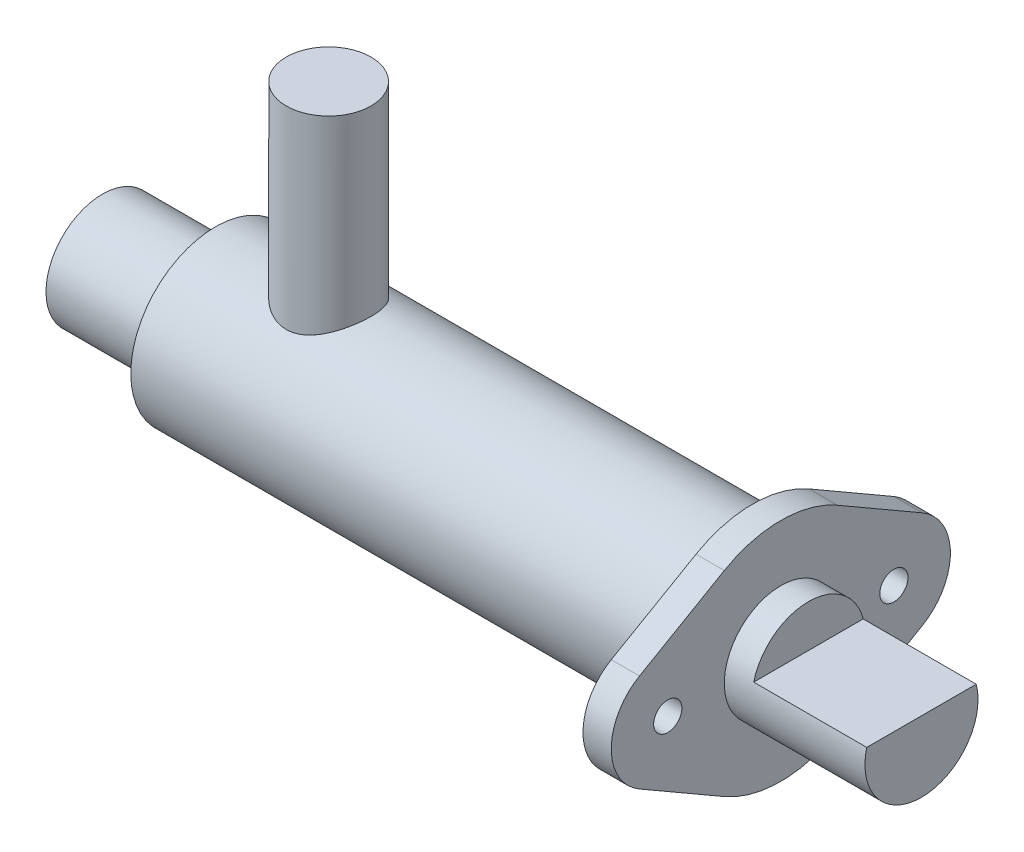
from build123d import *

# Parameters (mm, degrees)
SKETCH7_R           = 1.5875
BOSS_EXTRUDE2_DEPTH = 3.175
SKETCH5_R           = 6.35
CUT_EXTRUDE1_DEPTH  = 41.348883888
EXTRUDE1_START      = 57.15
SKETCH8_R           = 6.35
EXTRUDE1_DEPTH      = 57.15
CUT_EXTRUDE2_DEPTH  = 12.7
SKETCH10_R          = 4.7625
EXTRUDE2_DEPTH      = 30


with BuildPart() as part:
    # Sketch4 → Boss-Revolve2 (revolve)
    with BuildSketch(Plane.XY, mode=Mode.PRIVATE) as boss_revolve2_sk:
        Polygon((-47.625, 0), (-47.625, -6.35), (-34.925, -6.35), (-34.925, -9.525), (28.575, -9.525), (28.575, 0), align=None)
    revolve(boss_revolve2_sk.sketch.rotate(Axis((-47.625, 0, 0), (1, 0, 0)), 270), axis=Axis((-47.625, 0, 0), (1, 0, 0)))

    # Sketch7 → Boss-Extrude2 (add)
    with BuildSketch(Plane(origin=(28.575, 29.318732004, 10.174246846), x_dir=(0, 0.7071067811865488, -0.7071067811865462), z_dir=(1, 0, 0))):
        with BuildLine():
            Line((-20.873950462, -12.811868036), (-10.250193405, -15.65849516))
            ThreePointArc((-10.250193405, -15.65849516), (-4.556939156, -18.945497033), (-1.269937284, -24.638751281))
            Line((-1.269937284, -24.638751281), (1.57668984, -35.262508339))
            ThreePointArc((1.57668984, -35.262508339), (-0.066811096, -41.396137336), (-6.200440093, -43.039638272))
            Line((-6.200440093, -43.039638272), (-16.82419715, -40.193011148))
            ThreePointArc((-16.82419715, -40.193011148), (-22.517451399, -36.906009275), (-25.804453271, -31.212755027))
            Line((-25.804453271, -31.212755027), (-28.651080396, -20.588997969))
            ThreePointArc((-28.651080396, -20.588997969), (-27.007579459, -14.455368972), (-20.873950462, -12.811868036))
        make_face()
        with Locations(Location((-22.517451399, -18.945497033, 0), (0, 0, 315))):
            Circle(SKETCH7_R, mode=Mode.SUBTRACT)
        with Locations(Location((-4.556939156, -36.906009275, 0), (0, 0, 315))):
            Circle(SKETCH7_R, mode=Mode.SUBTRACT)
    extrude(amount=-BOSS_EXTRUDE2_DEPTH)

    # Sketch5 → Cut-Extrude1 (cut)
    with BuildSketch(Plane(origin=(28.575, 0, 0), x_dir=(0, 0, -1), z_dir=(1, 0, 0))):
        with Locations(Location((0, 0, 0), (0, 0, 180))):
            Circle(SKETCH5_R)
    extrude(amount=-CUT_EXTRUDE1_DEPTH, mode=Mode.SUBTRACT)

    # Sketch8 → Extrude1 (add)
    with BuildSketch(Plane(origin=(-12.773883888, 0, 0), x_dir=(0, 0, -1), z_dir=(1, 0, 0)).offset(EXTRUDE1_START)):
        with Locations(Location((0, 0, 0), (0, 0, 180))):
            Circle(SKETCH8_R)
    extrude(amount=-EXTRUDE1_DEPTH)

    # Sketch9 → Cut-Extrude2 (cut)
    with BuildSketch(Plane(origin=(44.376116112, 0, 0), x_dir=(0, 0, -1), z_dir=(1, 0, 0))):
        with BuildLine():
            Line((-6.148361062, 1.5875), (6.148361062, 1.5875))
            ThreePointArc((6.148361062, 1.5875), (0, 6.35), (-6.148361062, 1.5875))
        make_face()
    extrude(amount=-CUT_EXTRUDE2_DEPTH, mode=Mode.SUBTRACT)

    # Sketch10 → Extrude2 (add)
    with BuildSketch(Plane(origin=(0, 0, 0), x_dir=(1, 0, 0), z_dir=(0, 1, 0))):
        with Locations(Location((-22.225, 0, 0), (0, 0, 90))):
            Circle(SKETCH10_R)
    extrude(amount=EXTRUDE2_DEPTH)


solid = part.part
